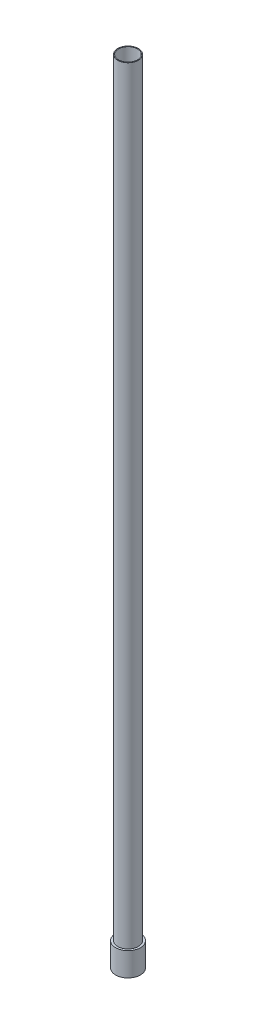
ISO-10303-21;
HEADER;
FILE_DESCRIPTION(('STEP AP214'),'2;1');
FILE_NAME('part.step','',(''),(''),'','','');
FILE_SCHEMA(('AUTOMOTIVE_DESIGN { 1 0 10303 214 1 1 1 1 }'));
ENDSEC;
DATA;
#1=APPLICATION_CONTEXT('core data for automotive mechanical design processes');
#2=APPLICATION_PROTOCOL_DEFINITION('international standard','automotive_design',2000,#1);
#3=PRODUCT_CONTEXT('',#1,'mechanical');
#4=PRODUCT('Part','Part','',(#3));
#5=PRODUCT_RELATED_PRODUCT_CATEGORY('part','',(#4));
#6=PRODUCT_DEFINITION_FORMATION('','',#4);
#7=PRODUCT_DEFINITION_CONTEXT('part definition',#1,'design');
#8=PRODUCT_DEFINITION('design','',#6,#7);
#9=PRODUCT_DEFINITION_SHAPE('','',#8);
#10=(LENGTH_UNIT() NAMED_UNIT(*) SI_UNIT(.MILLI.,.METRE.));
#11=(NAMED_UNIT(*) PLANE_ANGLE_UNIT() SI_UNIT($,.RADIAN.));
#12=(NAMED_UNIT(*) SI_UNIT($,.STERADIAN.) SOLID_ANGLE_UNIT());
#13=UNCERTAINTY_MEASURE_WITH_UNIT(LENGTH_MEASURE(1.E-05),#10,'distance_accuracy_value','');
#14=(GEOMETRIC_REPRESENTATION_CONTEXT(3) GLOBAL_UNCERTAINTY_ASSIGNED_CONTEXT((#13)) GLOBAL_UNIT_ASSIGNED_CONTEXT((#10,
#11,#12)) REPRESENTATION_CONTEXT('',''));
#15=CARTESIAN_POINT('',(0.,0.,0.));
#16=DIRECTION('',(0.,0.,1.));
#17=DIRECTION('',(1.,0.,0.));
#18=AXIS2_PLACEMENT_3D('',#15,#16,#17);
#19=CARTESIAN_POINT('',(0.,0.,0.));
#20=DIRECTION('',(0.,-1.,0.));
#21=DIRECTION('',(0.,0.,-1.));
#22=AXIS2_PLACEMENT_3D('',#19,#20,#21);
#23=CYLINDRICAL_SURFACE('',#22,3.6576);
#24=CARTESIAN_POINT('',(0.,304.8,0.));
#25=DIRECTION('',(0.,-1.,0.));
#26=DIRECTION('',(0.,0.,-1.));
#27=AXIS2_PLACEMENT_3D('',#24,#25,#26);
#28=CIRCLE('',#27,3.6576);
#29=CARTESIAN_POINT('',(0.,304.8,-3.6576));
#30=VERTEX_POINT('',#29);
#31=EDGE_CURVE('E52',#30,#30,#28,.T.);
#32=ORIENTED_EDGE('',*,*,#31,.F.);
#33=EDGE_LOOP('',(#32));
#34=FACE_BOUND('',#33,.T.);
#35=CARTESIAN_POINT('',(0.,0.,0.));
#36=DIRECTION('',(0.,-1.,0.));
#37=DIRECTION('',(0.,0.,-1.));
#38=AXIS2_PLACEMENT_3D('',#35,#36,#37);
#39=CIRCLE('',#38,3.6576);
#40=CARTESIAN_POINT('',(0.,0.,-3.6576));
#41=VERTEX_POINT('',#40);
#42=EDGE_CURVE('E10',#41,#41,#39,.T.);
#43=ORIENTED_EDGE('',*,*,#42,.T.);
#44=EDGE_LOOP('',(#43));
#45=FACE_BOUND('',#44,.T.);
#46=ADVANCED_FACE('F30',(#34,#45),#23,.F.);
#47=CARTESIAN_POINT('',(-3.6576,0.,0.));
#48=DIRECTION('',(0.,1.,0.));
#49=DIRECTION('',(0.,0.,1.));
#50=AXIS2_PLACEMENT_3D('',#47,#48,#49);
#51=PLANE('',#50);
#52=ORIENTED_EDGE('',*,*,#42,.F.);
#53=EDGE_LOOP('',(#52));
#54=FACE_BOUND('',#53,.T.);
#55=CARTESIAN_POINT('',(0.,0.,0.));
#56=DIRECTION('',(0.,-1.,0.));
#57=DIRECTION('',(0.,0.,-1.));
#58=AXIS2_PLACEMENT_3D('',#55,#56,#57);
#59=CIRCLE('',#58,4.7625);
#60=CARTESIAN_POINT('',(0.,0.,-4.7625));
#61=VERTEX_POINT('',#60);
#62=EDGE_CURVE('E36',#61,#61,#59,.T.);
#63=ORIENTED_EDGE('',*,*,#62,.T.);
#64=EDGE_LOOP('',(#63));
#65=FACE_BOUND('',#64,.T.);
#66=ADVANCED_FACE('F59',(#54,#65),#51,.F.);
#67=CARTESIAN_POINT('',(0.,0.,0.));
#68=DIRECTION('',(0.,-1.,0.));
#69=DIRECTION('',(0.,0.,-1.));
#70=AXIS2_PLACEMENT_3D('',#67,#68,#69);
#71=CYLINDRICAL_SURFACE('',#70,4.7625);
#72=ORIENTED_EDGE('',*,*,#62,.F.);
#73=EDGE_LOOP('',(#72));
#74=FACE_BOUND('',#73,.T.);
#75=CARTESIAN_POINT('',(0.,9.1186,0.));
#76=DIRECTION('',(0.,-1.,0.));
#77=DIRECTION('',(0.,0.,-1.));
#78=AXIS2_PLACEMENT_3D('',#75,#76,#77);
#79=CIRCLE('',#78,4.7625);
#80=CARTESIAN_POINT('',(0.,9.1186,-4.7625));
#81=VERTEX_POINT('',#80);
#82=EDGE_CURVE('E40',#81,#81,#79,.T.);
#83=ORIENTED_EDGE('',*,*,#82,.T.);
#84=EDGE_LOOP('',(#83));
#85=FACE_BOUND('',#84,.T.);
#86=ADVANCED_FACE('F63',(#74,#85),#71,.T.);
#87=CARTESIAN_POINT('',(-4.7625,9.1186,0.));
#88=DIRECTION('',(0.,-1.,0.));
#89=DIRECTION('',(0.,0.,-1.));
#90=AXIS2_PLACEMENT_3D('',#87,#88,#89);
#91=PLANE('',#90);
#92=ORIENTED_EDGE('',*,*,#82,.F.);
#93=EDGE_LOOP('',(#92));
#94=FACE_BOUND('',#93,.T.);
#95=CARTESIAN_POINT('',(0.,9.1186,0.));
#96=DIRECTION('',(0.,-1.,0.));
#97=DIRECTION('',(0.,0.,-1.));
#98=AXIS2_PLACEMENT_3D('',#95,#96,#97);
#99=CIRCLE('',#98,3.9624);
#100=CARTESIAN_POINT('',(0.,9.1186,-3.9624));
#101=VERTEX_POINT('',#100);
#102=EDGE_CURVE('E44',#101,#101,#99,.T.);
#103=ORIENTED_EDGE('',*,*,#102,.T.);
#104=EDGE_LOOP('',(#103));
#105=FACE_BOUND('',#104,.T.);
#106=ADVANCED_FACE('F68',(#94,#105),#91,.F.);
#107=CARTESIAN_POINT('',(0.,0.,0.));
#108=DIRECTION('',(0.,-1.,0.));
#109=DIRECTION('',(0.,0.,-1.));
#110=AXIS2_PLACEMENT_3D('',#107,#108,#109);
#111=CYLINDRICAL_SURFACE('',#110,3.9624);
#112=ORIENTED_EDGE('',*,*,#102,.F.);
#113=EDGE_LOOP('',(#112));
#114=FACE_BOUND('',#113,.T.);
#115=CARTESIAN_POINT('',(0.,304.8,0.));
#116=DIRECTION('',(0.,-1.,0.));
#117=DIRECTION('',(0.,0.,-1.));
#118=AXIS2_PLACEMENT_3D('',#115,#116,#117);
#119=CIRCLE('',#118,3.9624);
#120=CARTESIAN_POINT('',(0.,304.8,-3.9624));
#121=VERTEX_POINT('',#120);
#122=EDGE_CURVE('E49',#121,#121,#119,.T.);
#123=ORIENTED_EDGE('',*,*,#122,.T.);
#124=EDGE_LOOP('',(#123));
#125=FACE_BOUND('',#124,.T.);
#126=ADVANCED_FACE('F74',(#114,#125),#111,.T.);
#127=CARTESIAN_POINT('',(-3.9624,304.8,0.));
#128=DIRECTION('',(0.,-1.,0.));
#129=DIRECTION('',(0.,0.,-1.));
#130=AXIS2_PLACEMENT_3D('',#127,#128,#129);
#131=PLANE('',#130);
#132=ORIENTED_EDGE('',*,*,#122,.F.);
#133=EDGE_LOOP('',(#132));
#134=FACE_BOUND('',#133,.T.);
#135=ORIENTED_EDGE('',*,*,#31,.T.);
#136=EDGE_LOOP('',(#135));
#137=FACE_BOUND('',#136,.T.);
#138=ADVANCED_FACE('F56',(#134,#137),#131,.F.);
#139=CLOSED_SHELL('',(#46,#66,#86,#106,#126,#138));
#140=MANIFOLD_SOLID_BREP('B2',#139);
#141=ADVANCED_BREP_SHAPE_REPRESENTATION('',(#18,#140),#14);
#142=SHAPE_DEFINITION_REPRESENTATION(#9,#141);
ENDSEC;
END-ISO-10303-21;
